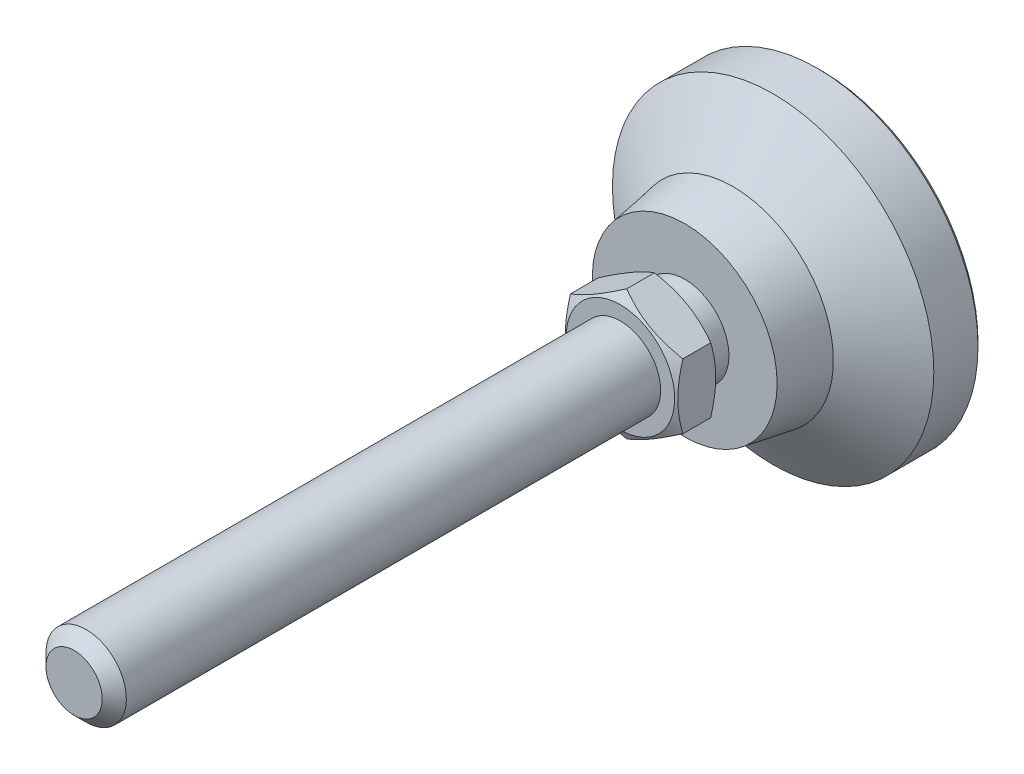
ISO-10303-21;
HEADER;
FILE_DESCRIPTION(('STEP AP214'),'2;1');
FILE_NAME('part.step','',(''),(''),'','','');
FILE_SCHEMA(('AUTOMOTIVE_DESIGN { 1 0 10303 214 1 1 1 1 }'));
ENDSEC;
DATA;
#1=APPLICATION_CONTEXT('core data for automotive mechanical design processes');
#2=APPLICATION_PROTOCOL_DEFINITION('international standard','automotive_design',2000,#1);
#3=PRODUCT_CONTEXT('',#1,'mechanical');
#4=PRODUCT('Part','Part','',(#3));
#5=PRODUCT_RELATED_PRODUCT_CATEGORY('part','',(#4));
#6=PRODUCT_DEFINITION_FORMATION('','',#4);
#7=PRODUCT_DEFINITION_CONTEXT('part definition',#1,'design');
#8=PRODUCT_DEFINITION('design','',#6,#7);
#9=PRODUCT_DEFINITION_SHAPE('','',#8);
#10=(LENGTH_UNIT() NAMED_UNIT(*) SI_UNIT(.MILLI.,.METRE.));
#11=(NAMED_UNIT(*) PLANE_ANGLE_UNIT() SI_UNIT($,.RADIAN.));
#12=(NAMED_UNIT(*) SI_UNIT($,.STERADIAN.) SOLID_ANGLE_UNIT());
#13=UNCERTAINTY_MEASURE_WITH_UNIT(LENGTH_MEASURE(1.E-05),#10,'distance_accuracy_value','');
#14=(GEOMETRIC_REPRESENTATION_CONTEXT(3) GLOBAL_UNCERTAINTY_ASSIGNED_CONTEXT((#13)) GLOBAL_UNIT_ASSIGNED_CONTEXT((#10,
#11,#12)) REPRESENTATION_CONTEXT('',''));
#15=CARTESIAN_POINT('',(0.,0.,0.));
#16=DIRECTION('',(0.,0.,1.));
#17=DIRECTION('',(1.,0.,0.));
#18=AXIS2_PLACEMENT_3D('',#15,#16,#17);
#19=CARTESIAN_POINT('',(-5.49999999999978,0.,20.));
#20=DIRECTION('',(0.,0.,1.));
#21=DIRECTION('',(0.,-1.,0.));
#22=AXIS2_PLACEMENT_3D('',#19,#20,#21);
#23=PLANE('',#22);
#24=CARTESIAN_POINT('',(0.,0.,20.));
#25=DIRECTION('',(0.,0.,-1.));
#26=DIRECTION('',(0.,1.,0.));
#27=AXIS2_PLACEMENT_3D('',#24,#25,#26);
#28=CIRCLE('',#27,5.49999999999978);
#29=CARTESIAN_POINT('',(0.,5.49999999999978,20.));
#30=VERTEX_POINT('',#29);
#31=EDGE_CURVE('E99',#30,#30,#28,.T.);
#32=ORIENTED_EDGE('',*,*,#31,.F.);
#33=EDGE_LOOP('',(#32));
#34=FACE_BOUND('',#33,.T.);
#35=CARTESIAN_POINT('',(0.,0.,20.));
#36=DIRECTION('',(0.,0.,-1.));
#37=DIRECTION('',(0.,1.,0.));
#38=AXIS2_PLACEMENT_3D('',#35,#36,#37);
#39=CIRCLE('',#38,6.75);
#40=CARTESIAN_POINT('',(0.,6.75,20.));
#41=VERTEX_POINT('',#40);
#42=EDGE_CURVE('E79',#41,#41,#39,.T.);
#43=ORIENTED_EDGE('',*,*,#42,.T.);
#44=EDGE_LOOP('',(#43));
#45=FACE_BOUND('',#44,.T.);
#46=ADVANCED_FACE('F14',(#34,#45),#23,.F.);
#47=CARTESIAN_POINT('',(0.,0.,-1.00000000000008));
#48=DIRECTION('',(0.,0.,-1.));
#49=DIRECTION('',(0.,1.,0.));
#50=AXIS2_PLACEMENT_3D('',#47,#48,#49);
#51=CYLINDRICAL_SURFACE('',#50,20.);
#52=CARTESIAN_POINT('',(0.,0.,0.500000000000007));
#53=DIRECTION('',(0.,0.,-1.));
#54=DIRECTION('',(0.,1.,0.));
#55=AXIS2_PLACEMENT_3D('',#52,#53,#54);
#56=CIRCLE('',#55,20.);
#57=CARTESIAN_POINT('',(0.,20.,0.500000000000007));
#58=VERTEX_POINT('',#57);
#59=EDGE_CURVE('E117',#58,#58,#56,.F.);
#60=ORIENTED_EDGE('',*,*,#59,.T.);
#61=EDGE_LOOP('',(#60));
#62=FACE_BOUND('',#61,.T.);
#63=CARTESIAN_POINT('',(0.,0.,6.));
#64=DIRECTION('',(0.,0.,-1.));
#65=DIRECTION('',(0.,1.,0.));
#66=AXIS2_PLACEMENT_3D('',#63,#64,#65);
#67=CIRCLE('',#66,20.);
#68=CARTESIAN_POINT('',(0.,20.,6.));
#69=VERTEX_POINT('',#68);
#70=EDGE_CURVE('E111',#69,#69,#67,.T.);
#71=ORIENTED_EDGE('',*,*,#70,.T.);
#72=EDGE_LOOP('',(#71));
#73=FACE_BOUND('',#72,.T.);
#74=ADVANCED_FACE('F239',(#62,#73),#51,.T.);
#75=CARTESIAN_POINT('',(0.,0.,11.));
#76=DIRECTION('',(0.,0.,-1.));
#77=DIRECTION('',(0.,1.,0.));
#78=AXIS2_PLACEMENT_3D('',#75,#76,#77);
#79=CONICAL_SURFACE('',#78,12.5,0.98279372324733);
#80=ORIENTED_EDGE('',*,*,#70,.F.);
#81=EDGE_LOOP('',(#80));
#82=FACE_BOUND('',#81,.T.);
#83=CARTESIAN_POINT('',(0.,0.,11.));
#84=DIRECTION('',(0.,0.,-1.));
#85=DIRECTION('',(0.,1.,0.));
#86=AXIS2_PLACEMENT_3D('',#83,#84,#85);
#87=CIRCLE('',#86,12.5);
#88=CARTESIAN_POINT('',(0.,12.5,11.));
#89=VERTEX_POINT('',#88);
#90=EDGE_CURVE('E108',#89,#89,#87,.T.);
#91=ORIENTED_EDGE('',*,*,#90,.T.);
#92=EDGE_LOOP('',(#91));
#93=FACE_BOUND('',#92,.T.);
#94=ADVANCED_FACE('F246',(#82,#93),#79,.T.);
#95=CARTESIAN_POINT('',(0.,0.,17.));
#96=DIRECTION('',(0.,0.,-1.));
#97=DIRECTION('',(0.,1.,0.));
#98=AXIS2_PLACEMENT_3D('',#95,#96,#97);
#99=CONICAL_SURFACE('',#98,11.5,0.165148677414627);
#100=ORIENTED_EDGE('',*,*,#90,.F.);
#101=EDGE_LOOP('',(#100));
#102=FACE_BOUND('',#101,.T.);
#103=CARTESIAN_POINT('',(0.,0.,17.));
#104=DIRECTION('',(0.,0.,-1.));
#105=DIRECTION('',(0.,1.,0.));
#106=AXIS2_PLACEMENT_3D('',#103,#104,#105);
#107=CIRCLE('',#106,11.5);
#108=CARTESIAN_POINT('',(0.,11.5,17.));
#109=VERTEX_POINT('',#108);
#110=EDGE_CURVE('E105',#109,#109,#107,.T.);
#111=ORIENTED_EDGE('',*,*,#110,.T.);
#112=EDGE_LOOP('',(#111));
#113=FACE_BOUND('',#112,.T.);
#114=ADVANCED_FACE('F258',(#102,#113),#99,.T.);
#115=CARTESIAN_POINT('',(-11.5,0.,17.));
#116=DIRECTION('',(0.,0.,-1.));
#117=DIRECTION('',(0.,1.,0.));
#118=AXIS2_PLACEMENT_3D('',#115,#116,#117);
#119=PLANE('',#118);
#120=ORIENTED_EDGE('',*,*,#110,.F.);
#121=EDGE_LOOP('',(#120));
#122=FACE_BOUND('',#121,.T.);
#123=CARTESIAN_POINT('',(0.,0.,17.));
#124=DIRECTION('',(0.,0.,-1.));
#125=DIRECTION('',(0.,1.,0.));
#126=AXIS2_PLACEMENT_3D('',#123,#124,#125);
#127=CIRCLE('',#126,5.49999999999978);
#128=CARTESIAN_POINT('',(0.,5.49999999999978,17.));
#129=VERTEX_POINT('',#128);
#130=EDGE_CURVE('E102',#129,#129,#127,.T.);
#131=ORIENTED_EDGE('',*,*,#130,.T.);
#132=EDGE_LOOP('',(#131));
#133=FACE_BOUND('',#132,.T.);
#134=ADVANCED_FACE('F254',(#122,#133),#119,.F.);
#135=CARTESIAN_POINT('',(0.,0.,-1.00000000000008));
#136=DIRECTION('',(0.,0.,-1.));
#137=DIRECTION('',(0.,1.,0.));
#138=AXIS2_PLACEMENT_3D('',#135,#136,#137);
#139=CYLINDRICAL_SURFACE('',#138,5.49999999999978);
#140=ORIENTED_EDGE('',*,*,#130,.F.);
#141=EDGE_LOOP('',(#140));
#142=FACE_BOUND('',#141,.T.);
#143=ORIENTED_EDGE('',*,*,#31,.T.);
#144=EDGE_LOOP('',(#143));
#145=FACE_BOUND('',#144,.T.);
#146=ADVANCED_FACE('F251',(#142,#145),#139,.T.);
#147=CARTESIAN_POINT('',(0.,0.,0.));
#148=DIRECTION('',(0.,0.,-1.));
#149=DIRECTION('',(0.,1.,0.));
#150=AXIS2_PLACEMENT_3D('',#147,#148,#149);
#151=PLANE('',#150);
#152=CARTESIAN_POINT('',(0.,0.,0.));
#153=DIRECTION('',(0.,0.,-1.));
#154=DIRECTION('',(0.,1.,0.));
#155=AXIS2_PLACEMENT_3D('',#152,#153,#154);
#156=CIRCLE('',#155,19.5);
#157=CARTESIAN_POINT('',(0.,19.5,0.));
#158=VERTEX_POINT('',#157);
#159=EDGE_CURVE('E114',#158,#158,#156,.T.);
#160=ORIENTED_EDGE('',*,*,#159,.T.);
#161=EDGE_LOOP('',(#160));
#162=FACE_BOUND('',#161,.T.);
#163=ADVANCED_FACE('F197',(#162),#151,.T.);
#164=CARTESIAN_POINT('',(0.,0.,0.));
#165=DIRECTION('',(0.,0.,1.));
#166=DIRECTION('',(0.,-1.,0.));
#167=AXIS2_PLACEMENT_3D('',#164,#165,#166);
#168=CONICAL_SURFACE('',#167,19.5,0.785398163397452);
#169=ORIENTED_EDGE('',*,*,#59,.F.);
#170=EDGE_LOOP('',(#169));
#171=FACE_BOUND('',#170,.T.);
#172=ORIENTED_EDGE('',*,*,#159,.F.);
#173=EDGE_LOOP('',(#172));
#174=FACE_BOUND('',#173,.T.);
#175=ADVANCED_FACE('F16',(#171,#174),#168,.T.);
#176=CARTESIAN_POINT('',(0.,0.,20.));
#177=DIRECTION('',(0.,0.,1.));
#178=DIRECTION('',(0.,-1.,0.));
#179=AXIS2_PLACEMENT_3D('',#176,#177,#178);
#180=CONICAL_SURFACE('',#179,6.75,1.0471975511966);
#181=CARTESIAN_POINT('',(-7.,10.8136101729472,23.5400483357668));
#182=CARTESIAN_POINT('',(-7.,10.5082244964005,23.3920791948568));
#183=CARTESIAN_POINT('',(-7.,10.2021332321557,23.2455411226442));
#184=CARTESIAN_POINT('',(-7.,9.58816411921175,22.9561328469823));
#185=CARTESIAN_POINT('',(-7.,9.28028599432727,22.8132632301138));
#186=CARTESIAN_POINT('',(-7.,8.66076112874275,22.5312697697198));
#187=CARTESIAN_POINT('',(-7.,8.34910296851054,22.3921709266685));
#188=CARTESIAN_POINT('',(-7.,7.72329302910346,22.1197223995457));
#189=CARTESIAN_POINT('',(-7.,7.40914136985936,21.9863724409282));
#190=CARTESIAN_POINT('',(-7.,6.76787104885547,21.7228423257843));
#191=CARTESIAN_POINT('',(-7.,6.44065611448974,21.5928951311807));
#192=CARTESIAN_POINT('',(-7.,5.78238328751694,21.3429382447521));
#193=CARTESIAN_POINT('',(-7.,5.45132496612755,21.2229296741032));
#194=CARTESIAN_POINT('',(-7.,4.78546807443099,20.9960318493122));
#195=CARTESIAN_POINT('',(-7.,4.45067878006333,20.8891156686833));
#196=CARTESIAN_POINT('',(-7.,3.776310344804,20.6918596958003));
#197=CARTESIAN_POINT('',(-7.,3.43673276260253,20.6015146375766));
#198=CARTESIAN_POINT('',(-7.,2.75441347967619,20.4422483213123));
#199=CARTESIAN_POINT('',(-7.,2.4116992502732,20.3732125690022));
#200=CARTESIAN_POINT('',(-7.,1.89454111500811,20.2886510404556));
#201=CARTESIAN_POINT('',(-7.,1.72162758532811,20.2636280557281));
#202=CARTESIAN_POINT('',(-7.,1.37495549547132,20.2204045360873));
#203=CARTESIAN_POINT('',(-7.,1.20119701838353,20.202203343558));
#204=CARTESIAN_POINT('',(-7.,0.85531918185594,20.1732121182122));
#205=CARTESIAN_POINT('',(-7.,0.683207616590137,20.1623294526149));
#206=CARTESIAN_POINT('',(-7.,0.338678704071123,20.147849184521));
#207=CARTESIAN_POINT('',(-7.,0.166261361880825,20.1442514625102));
#208=CARTESIAN_POINT('',(-7.,-0.178571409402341,20.1444267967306));
#209=CARTESIAN_POINT('',(-7.,-0.350986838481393,20.1481998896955));
#210=CARTESIAN_POINT('',(-7.,-0.695506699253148,20.1630253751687));
#211=CARTESIAN_POINT('',(-7.,-0.867611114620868,20.1740781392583));
#212=CARTESIAN_POINT('',(-7.,-1.28251851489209,20.2092666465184));
#213=CARTESIAN_POINT('',(-7.,-1.5250286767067,20.236927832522));
#214=CARTESIAN_POINT('',(-7.,-2.00820982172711,20.3051851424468));
#215=CARTESIAN_POINT('',(-7.,-2.24888054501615,20.3457830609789));
#216=CARTESIAN_POINT('',(-7.,-2.96788042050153,20.4848258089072));
#217=CARTESIAN_POINT('',(-7.,-3.44292089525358,20.600493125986));
#218=CARTESIAN_POINT('',(-7.,-4.15317912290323,20.8005767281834));
#219=CARTESIAN_POINT('',(-7.,-4.39209330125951,20.8726218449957));
#220=CARTESIAN_POINT('',(-7.,-4.86760030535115,21.0240718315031));
#221=CARTESIAN_POINT('',(-7.,-5.10419311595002,21.1034767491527));
#222=CARTESIAN_POINT('',(-7.,-5.57513421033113,21.2683825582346));
#223=CARTESIAN_POINT('',(-7.,-5.80948323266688,21.3538813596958));
#224=CARTESIAN_POINT('',(-7.,-6.27624792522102,21.5299812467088));
#225=CARTESIAN_POINT('',(-7.,-6.50866361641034,21.6205822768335));
#226=CARTESIAN_POINT('',(-7.,-7.0502709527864,21.837469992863));
#227=CARTESIAN_POINT('',(-7.,-7.35878563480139,21.965443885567));
#228=CARTESIAN_POINT('',(-7.,-7.97325115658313,22.2274226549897));
#229=CARTESIAN_POINT('',(-7.,-8.27920184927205,22.3614278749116));
#230=CARTESIAN_POINT('',(-7.,-8.88900199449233,22.6342773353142));
#231=CARTESIAN_POINT('',(-7.,-9.19285103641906,22.7731224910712));
#232=CARTESIAN_POINT('',(-7.,-9.79874619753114,23.0546992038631));
#233=CARTESIAN_POINT('',(-7.,-10.1007922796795,23.1974308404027));
#234=CARTESIAN_POINT('',(-7.,-10.7036741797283,23.4862066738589));
#235=CARTESIAN_POINT('',(-7.,-11.0045084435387,23.6322541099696));
#236=CARTESIAN_POINT('',(-7.,-11.6048939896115,23.9269650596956));
#237=CARTESIAN_POINT('',(-7.,-11.904445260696,24.0756285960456));
#238=CARTESIAN_POINT('',(-7.,-12.8014014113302,24.524819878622));
#239=CARTESIAN_POINT('',(-7.,-13.3971848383,24.828585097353));
#240=CARTESIAN_POINT('',(-7.,-14.5369005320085,25.4170734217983));
#241=CARTESIAN_POINT('',(-7.,-15.081081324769,25.7013173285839));
#242=CARTESIAN_POINT('',(-7.,-16.1674154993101,26.27369406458));
#243=CARTESIAN_POINT('',(-7.,-16.7095688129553,26.5618270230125));
#244=CARTESIAN_POINT('',(-7.,-17.7909917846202,27.1403679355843));
#245=CARTESIAN_POINT('',(-7.,-18.3302652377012,27.430768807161));
#246=CARTESIAN_POINT('',(-7.,-19.407511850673,28.013905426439));
#247=CARTESIAN_POINT('',(-7.,-19.9454850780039,28.3066410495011));
#248=CARTESIAN_POINT('',(-7.,-20.482977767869,28.6002504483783));
#249=B_SPLINE_CURVE_WITH_KNOTS('',3,(#181,#182,#183,#184,#185,#186,#187,#188,#189,#190,#191,
#192,#193,#194,#195,#196,#197,#198,#199,#200,#201,#202,#203,#204,#205,#206,#207,#208,#209,#210,
#211,#212,#213,#214,#215,#216,#217,#218,#219,#220,#221,#222,#223,#224,#225,#226,#227,#228,#229,
#230,#231,#232,#233,#234,#235,#236,#237,#238,#239,#240,#241,#242,#243,#244,#245,#246,#247,#248),
.UNSPECIFIED.,.F.,.F.,(4,2,2,2,2,2,2,2,2,2,2,2,2,2,2,2,2,2,2,2,2,2,2,2,2,2,2,2,2,2,2,2,2,4),(0.,
1.01804873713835,2.03625925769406,3.06008465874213,4.08386111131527,5.13995695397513,
6.19617177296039,7.25017648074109,8.30384566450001,9.35175079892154,9.87578158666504,
10.3997618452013,10.9169784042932,11.4341864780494,11.951397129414,12.4686341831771,
13.2004675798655,13.9324025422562,15.3971016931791,16.1456624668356,16.8942281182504,
17.6425382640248,18.3908402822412,19.3927663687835,20.3947495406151,21.3969232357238,
22.3991174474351,23.402336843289,24.4055649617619,26.4117673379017,28.2535827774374,
30.0954595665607,31.9329345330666,33.7703120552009),.UNSPECIFIED.);
#250=CARTESIAN_POINT('',(-7.,4.04145188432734,20.7695523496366));
#251=VERTEX_POINT('',#250);
#252=CARTESIAN_POINT('',(-7.,-4.04145188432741,20.7695523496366));
#253=VERTEX_POINT('',#252);
#254=EDGE_CURVE('E85',#251,#253,#249,.T.);
#255=ORIENTED_EDGE('',*,*,#254,.F.);
#256=CARTESIAN_POINT('',(0.000200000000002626,8.08301923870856,20.7696190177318));
#257=CARTESIAN_POINT('',(-0.153667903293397,7.99418356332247,20.7183374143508));
#258=CARTESIAN_POINT('',(-0.308109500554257,7.90501666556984,20.669383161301));
#259=CARTESIAN_POINT('',(-0.618246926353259,7.725958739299,20.5767703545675));
#260=CARTESIAN_POINT('',(-0.773943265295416,7.63606741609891,20.5331140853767));
#261=CARTESIAN_POINT('',(-1.24352516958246,7.36495417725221,20.4109491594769));
#262=CARTESIAN_POINT('',(-1.5592643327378,7.18266208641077,20.3414631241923));
#263=CARTESIAN_POINT('',(-2.03176224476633,6.90986528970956,20.2599825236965));
#264=CARTESIAN_POINT('',(-2.18710922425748,6.82017566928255,20.2367710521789));
#265=CARTESIAN_POINT('',(-2.49850511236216,6.64039116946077,20.1978487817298));
#266=CARTESIAN_POINT('',(-2.6545539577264,6.55029632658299,20.1821373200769));
#267=CARTESIAN_POINT('',(-2.96692267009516,6.36995016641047,20.1586154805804));
#268=CARTESIAN_POINT('',(-3.12324202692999,6.27969914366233,20.1507961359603));
#269=CARTESIAN_POINT('',(-3.43601650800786,6.09911871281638,20.1432178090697));
#270=CARTESIAN_POINT('',(-3.59247162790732,6.00878930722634,20.1434585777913));
#271=CARTESIAN_POINT('',(-4.02110687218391,5.76131663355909,20.1551972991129));
#272=CARTESIAN_POINT('',(-4.29314668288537,5.6042543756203,20.1749033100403));
#273=CARTESIAN_POINT('',(-4.83541944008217,5.29117305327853,20.2373910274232));
#274=CARTESIAN_POINT('',(-5.10565047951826,5.13515508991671,20.2801940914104));
#275=CARTESIAN_POINT('',(-5.64901454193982,4.82144370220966,20.3871892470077));
#276=CARTESIAN_POINT('',(-5.92207900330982,4.66378986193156,20.4518346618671));
#277=CARTESIAN_POINT('',(-6.46413578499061,4.35083323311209,20.5985536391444));
#278=CARTESIAN_POINT('',(-6.73313504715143,4.19552643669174,20.6805927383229));
#279=CARTESIAN_POINT('',(-7.0002,4.0413364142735,20.7696190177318));
#280=B_SPLINE_CURVE_WITH_KNOTS('',3,(#256,#257,#258,#259,#260,#261,#262,#263,#264,#265,#266,
#267,#268,#269,#270,#271,#272,#273,#274,#275,#276,#277,#278,#279),.UNSPECIFIED.,.F.,.F.,(4,2,2,
2,2,2,2,2,2,2,2,4),(0.,0.554727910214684,1.10969417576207,2.22193274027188,2.76443041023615,
3.30688013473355,3.84871284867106,4.39052882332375,5.33376515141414,6.27787517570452,
7.24292418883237,8.20607866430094),.UNSPECIFIED.);
#281=CARTESIAN_POINT('',(0.,8.08290376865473,20.7695523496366));
#282=VERTEX_POINT('',#281);
#283=EDGE_CURVE('E206',#282,#251,#280,.T.);
#284=ORIENTED_EDGE('',*,*,#283,.F.);
#285=CARTESIAN_POINT('',(7.0002,4.04133641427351,20.7696190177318));
#286=CARTESIAN_POINT('',(6.8463320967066,4.1301720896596,20.7183374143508));
#287=CARTESIAN_POINT('',(6.69189049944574,4.21933898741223,20.669383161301));
#288=CARTESIAN_POINT('',(6.38175307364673,4.39839691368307,20.5767703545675));
#289=CARTESIAN_POINT('',(6.22605673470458,4.48828823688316,20.5331140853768));
#290=CARTESIAN_POINT('',(5.75647483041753,4.75940147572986,20.4109491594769));
#291=CARTESIAN_POINT('',(5.44073566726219,4.9416935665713,20.3414631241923));
#292=CARTESIAN_POINT('',(4.96823775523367,5.21449036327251,20.2599825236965));
#293=CARTESIAN_POINT('',(4.81289077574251,5.30417998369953,20.2367710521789));
#294=CARTESIAN_POINT('',(4.50149488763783,5.4839644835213,20.1978487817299));
#295=CARTESIAN_POINT('',(4.34544604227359,5.57405932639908,20.1821373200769));
#296=CARTESIAN_POINT('',(4.03307732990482,5.7544054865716,20.1586154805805));
#297=CARTESIAN_POINT('',(3.87675797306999,5.84465650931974,20.1507961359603));
#298=CARTESIAN_POINT('',(3.56398349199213,6.02523694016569,20.1432178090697));
#299=CARTESIAN_POINT('',(3.40752837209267,6.11556634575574,20.1434585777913));
#300=CARTESIAN_POINT('',(2.97889312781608,6.36303901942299,20.1551972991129));
#301=CARTESIAN_POINT('',(2.70685331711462,6.52010127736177,20.1749033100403));
#302=CARTESIAN_POINT('',(2.16458055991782,6.83318259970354,20.2373910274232));
#303=CARTESIAN_POINT('',(1.89434952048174,6.98920056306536,20.2801940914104));
#304=CARTESIAN_POINT('',(1.35098545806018,7.30291195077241,20.3871892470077));
#305=CARTESIAN_POINT('',(1.07792099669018,7.46056579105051,20.4518346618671));
#306=CARTESIAN_POINT('',(0.535864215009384,7.77352241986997,20.5985536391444));
#307=CARTESIAN_POINT('',(0.266864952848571,7.92882921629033,20.6805927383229));
#308=CARTESIAN_POINT('',(-0.000199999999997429,8.08301923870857,20.7696190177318));
#309=B_SPLINE_CURVE_WITH_KNOTS('',3,(#285,#286,#287,#288,#289,#290,#291,#292,#293,#294,#295,
#296,#297,#298,#299,#300,#301,#302,#303,#304,#305,#306,#307,#308),.UNSPECIFIED.,.F.,.F.,(4,2,2,
2,2,2,2,2,2,2,2,4),(0.,0.554727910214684,1.10969417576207,2.22193274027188,2.76443041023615,
3.30688013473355,3.84871284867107,4.39052882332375,5.33376515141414,6.27787517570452,
7.24292418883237,8.20607866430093),.UNSPECIFIED.);
#310=CARTESIAN_POINT('',(7.,4.04145188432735,20.7695523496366));
#311=VERTEX_POINT('',#310);
#312=EDGE_CURVE('E213',#311,#282,#309,.T.);
#313=ORIENTED_EDGE('',*,*,#312,.F.);
#314=CARTESIAN_POINT('',(7.,10.8136101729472,23.5400483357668));
#315=CARTESIAN_POINT('',(7.,10.5082244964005,23.3920791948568));
#316=CARTESIAN_POINT('',(7.,10.2021332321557,23.2455411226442));
#317=CARTESIAN_POINT('',(7.,9.58816411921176,22.9561328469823));
#318=CARTESIAN_POINT('',(7.,9.28028599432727,22.8132632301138));
#319=CARTESIAN_POINT('',(7.,8.66076112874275,22.5312697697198));
#320=CARTESIAN_POINT('',(7.,8.34910296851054,22.3921709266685));
#321=CARTESIAN_POINT('',(7.,7.72329302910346,22.1197223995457));
#322=CARTESIAN_POINT('',(7.,7.40914136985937,21.9863724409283));
#323=CARTESIAN_POINT('',(7.,6.76787104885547,21.7228423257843));
#324=CARTESIAN_POINT('',(7.,6.44065611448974,21.5928951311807));
#325=CARTESIAN_POINT('',(7.,5.78238328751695,21.3429382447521));
#326=CARTESIAN_POINT('',(7.,5.45132496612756,21.2229296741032));
#327=CARTESIAN_POINT('',(7.,4.78546807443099,20.9960318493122));
#328=CARTESIAN_POINT('',(7.,4.45067878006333,20.8891156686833));
#329=CARTESIAN_POINT('',(7.,3.776310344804,20.6918596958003));
#330=CARTESIAN_POINT('',(7.,3.43673276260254,20.6015146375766));
#331=CARTESIAN_POINT('',(7.,2.7544134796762,20.4422483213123));
#332=CARTESIAN_POINT('',(7.,2.4116992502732,20.3732125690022));
#333=CARTESIAN_POINT('',(7.,1.89454111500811,20.2886510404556));
#334=CARTESIAN_POINT('',(7.,1.72162758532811,20.2636280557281));
#335=CARTESIAN_POINT('',(7.,1.37495549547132,20.2204045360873));
#336=CARTESIAN_POINT('',(7.,1.20119701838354,20.202203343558));
#337=CARTESIAN_POINT('',(7.,0.855319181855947,20.1732121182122));
#338=CARTESIAN_POINT('',(7.,0.683207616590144,20.1623294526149));
#339=CARTESIAN_POINT('',(7.,0.33867870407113,20.147849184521));
#340=CARTESIAN_POINT('',(7.,0.166261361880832,20.1442514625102));
#341=CARTESIAN_POINT('',(7.,-0.178571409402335,20.1444267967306));
#342=CARTESIAN_POINT('',(7.,-0.350986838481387,20.1481998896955));
#343=CARTESIAN_POINT('',(7.,-0.695506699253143,20.1630253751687));
#344=CARTESIAN_POINT('',(7.,-0.867611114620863,20.1740781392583));
#345=CARTESIAN_POINT('',(7.,-1.28251851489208,20.2092666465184));
#346=CARTESIAN_POINT('',(7.,-1.52502867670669,20.236927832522));
#347=CARTESIAN_POINT('',(7.,-2.00820982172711,20.3051851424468));
#348=CARTESIAN_POINT('',(7.,-2.24888054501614,20.3457830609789));
#349=CARTESIAN_POINT('',(7.,-2.96788042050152,20.4848258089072));
#350=CARTESIAN_POINT('',(7.,-3.44292089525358,20.600493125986));
#351=CARTESIAN_POINT('',(7.,-4.15317912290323,20.8005767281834));
#352=CARTESIAN_POINT('',(7.,-4.39209330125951,20.8726218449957));
#353=CARTESIAN_POINT('',(7.,-4.86760030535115,21.0240718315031));
#354=CARTESIAN_POINT('',(7.,-5.10419311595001,21.1034767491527));
#355=CARTESIAN_POINT('',(7.,-5.57513421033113,21.2683825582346));
#356=CARTESIAN_POINT('',(7.,-5.80948323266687,21.3538813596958));
#357=CARTESIAN_POINT('',(7.,-6.27624792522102,21.5299812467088));
#358=CARTESIAN_POINT('',(7.,-6.50866361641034,21.6205822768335));
#359=CARTESIAN_POINT('',(7.,-7.0502709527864,21.837469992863));
#360=CARTESIAN_POINT('',(7.,-7.35878563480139,21.965443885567));
#361=CARTESIAN_POINT('',(7.,-7.97325115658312,22.2274226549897));
#362=CARTESIAN_POINT('',(7.,-8.27920184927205,22.3614278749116));
#363=CARTESIAN_POINT('',(7.,-8.88900199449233,22.6342773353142));
#364=CARTESIAN_POINT('',(7.,-9.19285103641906,22.7731224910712));
#365=CARTESIAN_POINT('',(7.,-9.79874619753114,23.0546992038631));
#366=CARTESIAN_POINT('',(7.,-10.1007922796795,23.1974308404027));
#367=CARTESIAN_POINT('',(7.,-10.7036741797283,23.4862066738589));
#368=CARTESIAN_POINT('',(7.,-11.0045084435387,23.6322541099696));
#369=CARTESIAN_POINT('',(7.,-11.6048939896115,23.9269650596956));
#370=CARTESIAN_POINT('',(7.,-11.904445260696,24.0756285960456));
#371=CARTESIAN_POINT('',(7.,-12.8014014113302,24.524819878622));
#372=CARTESIAN_POINT('',(7.,-13.3971848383,24.828585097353));
#373=CARTESIAN_POINT('',(7.,-14.5369005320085,25.4170734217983));
#374=CARTESIAN_POINT('',(7.,-15.081081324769,25.7013173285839));
#375=CARTESIAN_POINT('',(7.,-16.1674154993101,26.27369406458));
#376=CARTESIAN_POINT('',(7.,-16.7095688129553,26.5618270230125));
#377=CARTESIAN_POINT('',(7.,-17.7909917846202,27.1403679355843));
#378=CARTESIAN_POINT('',(7.,-18.3302652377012,27.430768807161));
#379=CARTESIAN_POINT('',(7.,-19.407511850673,28.013905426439));
#380=CARTESIAN_POINT('',(7.,-19.9454850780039,28.3066410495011));
#381=CARTESIAN_POINT('',(7.,-20.482977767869,28.6002504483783));
#382=B_SPLINE_CURVE_WITH_KNOTS('',3,(#314,#315,#316,#317,#318,#319,#320,#321,#322,#323,#324,
#325,#326,#327,#328,#329,#330,#331,#332,#333,#334,#335,#336,#337,#338,#339,#340,#341,#342,#343,
#344,#345,#346,#347,#348,#349,#350,#351,#352,#353,#354,#355,#356,#357,#358,#359,#360,#361,#362,
#363,#364,#365,#366,#367,#368,#369,#370,#371,#372,#373,#374,#375,#376,#377,#378,#379,#380,#381),
.UNSPECIFIED.,.F.,.F.,(4,2,2,2,2,2,2,2,2,2,2,2,2,2,2,2,2,2,2,2,2,2,2,2,2,2,2,2,2,2,2,2,2,4),(0.,
1.01804873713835,2.03625925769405,3.06008465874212,4.08386111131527,5.13995695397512,
6.19617177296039,7.25017648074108,8.30384566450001,9.35175079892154,9.87578158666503,
10.3997618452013,10.9169784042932,11.4341864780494,11.951397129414,12.4686341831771,
13.2004675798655,13.9324025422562,15.3971016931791,16.1456624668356,16.8942281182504,
17.6425382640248,18.3908402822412,19.3927663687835,20.3947495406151,21.3969232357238,
22.3991174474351,23.402336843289,24.4055649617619,26.4117673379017,28.2535827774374,
30.0954595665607,31.9329345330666,33.7703120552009),.UNSPECIFIED.);
#383=CARTESIAN_POINT('',(7.,-4.04145188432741,20.7695523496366));
#384=VERTEX_POINT('',#383);
#385=EDGE_CURVE('E35',#384,#311,#382,.F.);
#386=ORIENTED_EDGE('',*,*,#385,.F.);
#387=CARTESIAN_POINT('',(-0.000199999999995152,-8.08301923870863,20.7696190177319));
#388=CARTESIAN_POINT('',(0.153667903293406,-7.99418356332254,20.7183374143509));
#389=CARTESIAN_POINT('',(0.308109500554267,-7.90501666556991,20.669383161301));
#390=CARTESIAN_POINT('',(0.618246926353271,-7.72595873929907,20.5767703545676));
#391=CARTESIAN_POINT('',(0.773943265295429,-7.63606741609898,20.5331140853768));
#392=CARTESIAN_POINT('',(1.24352516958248,-7.36495417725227,20.4109491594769));
#393=CARTESIAN_POINT('',(1.55926433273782,-7.18266208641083,20.3414631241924));
#394=CARTESIAN_POINT('',(2.03176224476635,-6.90986528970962,20.2599825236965));
#395=CARTESIAN_POINT('',(2.18710922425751,-6.82017566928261,20.2367710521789));
#396=CARTESIAN_POINT('',(2.49850511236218,-6.64039116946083,20.1978487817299));
#397=CARTESIAN_POINT('',(2.65455395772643,-6.55029632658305,20.1821373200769));
#398=CARTESIAN_POINT('',(2.9669226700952,-6.36995016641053,20.1586154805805));
#399=CARTESIAN_POINT('',(3.12324202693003,-6.27969914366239,20.1507961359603));
#400=CARTESIAN_POINT('',(3.43601650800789,-6.09911871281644,20.1432178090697));
#401=CARTESIAN_POINT('',(3.59247162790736,-6.00878930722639,20.1434585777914));
#402=CARTESIAN_POINT('',(4.02110687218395,-5.76131663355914,20.1551972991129));
#403=CARTESIAN_POINT('',(4.29314668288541,-5.60425437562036,20.1749033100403));
#404=CARTESIAN_POINT('',(4.8354194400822,-5.29117305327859,20.2373910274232));
#405=CARTESIAN_POINT('',(5.10565047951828,-5.13515508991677,20.2801940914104));
#406=CARTESIAN_POINT('',(5.64901454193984,-4.82144370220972,20.3871892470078));
#407=CARTESIAN_POINT('',(5.92207900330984,-4.66378986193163,20.4518346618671));
#408=CARTESIAN_POINT('',(6.46413578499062,-4.35083323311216,20.5985536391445));
#409=CARTESIAN_POINT('',(6.73313504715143,-4.19552643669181,20.680592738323));
#410=CARTESIAN_POINT('',(7.0002,-4.04133641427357,20.7696190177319));
#411=B_SPLINE_CURVE_WITH_KNOTS('',3,(#387,#388,#389,#390,#391,#392,#393,#394,#395,#396,#397,
#398,#399,#400,#401,#402,#403,#404,#405,#406,#407,#408,#409,#410),.UNSPECIFIED.,.F.,.F.,(4,2,2,
2,2,2,2,2,2,2,2,4),(0.,0.554727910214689,1.10969417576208,2.2219327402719,2.76443041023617,
3.30688013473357,3.8487128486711,4.39052882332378,5.33376515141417,6.27787517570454,
7.24292418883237,8.20607866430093),.UNSPECIFIED.);
#412=CARTESIAN_POINT('',(0.,-8.08290376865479,20.7695523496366));
#413=VERTEX_POINT('',#412);
#414=EDGE_CURVE('E72',#413,#384,#411,.T.);
#415=ORIENTED_EDGE('',*,*,#414,.F.);
#416=CARTESIAN_POINT('',(-7.0002,-4.04133641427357,20.7696190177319));
#417=CARTESIAN_POINT('',(-6.8463320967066,-4.13017208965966,20.7183374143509));
#418=CARTESIAN_POINT('',(-6.69189049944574,-4.21933898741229,20.669383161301));
#419=CARTESIAN_POINT('',(-6.38175307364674,-4.39839691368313,20.5767703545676));
#420=CARTESIAN_POINT('',(-6.22605673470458,-4.48828823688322,20.5331140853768));
#421=CARTESIAN_POINT('',(-5.75647483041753,-4.75940147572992,20.4109491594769));
#422=CARTESIAN_POINT('',(-5.44073566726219,-4.94169356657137,20.3414631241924));
#423=CARTESIAN_POINT('',(-4.96823775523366,-5.21449036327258,20.2599825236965));
#424=CARTESIAN_POINT('',(-4.8128907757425,-5.30417998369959,20.2367710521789));
#425=CARTESIAN_POINT('',(-4.50149488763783,-5.48396448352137,20.1978487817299));
#426=CARTESIAN_POINT('',(-4.34544604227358,-5.57405932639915,20.1821373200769));
#427=CARTESIAN_POINT('',(-4.03307732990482,-5.75440548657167,20.1586154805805));
#428=CARTESIAN_POINT('',(-3.87675797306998,-5.84465650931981,20.1507961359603));
#429=CARTESIAN_POINT('',(-3.56398349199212,-6.02523694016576,20.1432178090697));
#430=CARTESIAN_POINT('',(-3.40752837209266,-6.11556634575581,20.1434585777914));
#431=CARTESIAN_POINT('',(-2.97889312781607,-6.36303901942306,20.1551972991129));
#432=CARTESIAN_POINT('',(-2.7068533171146,-6.52010127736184,20.1749033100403));
#433=CARTESIAN_POINT('',(-2.16458055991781,-6.83318259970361,20.2373910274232));
#434=CARTESIAN_POINT('',(-1.89434952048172,-6.98920056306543,20.2801940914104));
#435=CARTESIAN_POINT('',(-1.35098545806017,-7.30291195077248,20.3871892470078));
#436=CARTESIAN_POINT('',(-1.07792099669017,-7.46056579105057,20.4518346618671));
#437=CARTESIAN_POINT('',(-0.535864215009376,-7.77352241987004,20.5985536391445));
#438=CARTESIAN_POINT('',(-0.266864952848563,-7.92882921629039,20.680592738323));
#439=CARTESIAN_POINT('',(0.000200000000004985,-8.08301923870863,20.7696190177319));
#440=B_SPLINE_CURVE_WITH_KNOTS('',3,(#416,#417,#418,#419,#420,#421,#422,#423,#424,#425,#426,
#427,#428,#429,#430,#431,#432,#433,#434,#435,#436,#437,#438,#439),.UNSPECIFIED.,.F.,.F.,(4,2,2,
2,2,2,2,2,2,2,2,4),(0.,0.554727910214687,1.10969417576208,2.22193274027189,2.76443041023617,
3.30688013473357,3.84871284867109,4.39052882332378,5.33376515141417,6.27787517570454,
7.24292418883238,8.20607866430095),.UNSPECIFIED.);
#441=EDGE_CURVE('E75',#253,#413,#440,.T.);
#442=ORIENTED_EDGE('',*,*,#441,.F.);
#443=EDGE_LOOP('',(#255,#284,#313,#386,#415,#442));
#444=FACE_BOUND('',#443,.T.);
#445=ORIENTED_EDGE('',*,*,#42,.F.);
#446=EDGE_LOOP('',(#445));
#447=FACE_BOUND('',#446,.T.);
#448=ADVANCED_FACE('F73',(#444,#447),#180,.T.);
#449=CARTESIAN_POINT('',(0.,0.,93.));
#450=DIRECTION('',(0.,0.,-1.));
#451=DIRECTION('',(0.,1.,0.));
#452=AXIS2_PLACEMENT_3D('',#449,#450,#451);
#453=PLANE('',#452);
#454=CARTESIAN_POINT('',(0.,0.,93.));
#455=DIRECTION('',(0.,0.,-1.));
#456=DIRECTION('',(0.,1.,0.));
#457=AXIS2_PLACEMENT_3D('',#454,#455,#456);
#458=CIRCLE('',#457,3.5);
#459=CARTESIAN_POINT('',(0.,3.5,93.));
#460=VERTEX_POINT('',#459);
#461=EDGE_CURVE('E90',#460,#460,#458,.T.);
#462=ORIENTED_EDGE('',*,*,#461,.F.);
#463=EDGE_LOOP('',(#462));
#464=FACE_BOUND('',#463,.T.);
#465=ADVANCED_FACE('F319',(#464),#453,.F.);
#466=CARTESIAN_POINT('',(0.,0.,93.));
#467=DIRECTION('',(0.,0.,-1.));
#468=DIRECTION('',(0.,1.,0.));
#469=AXIS2_PLACEMENT_3D('',#466,#467,#468);
#470=CONICAL_SURFACE('',#469,3.5,0.785398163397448);
#471=CARTESIAN_POINT('',(0.,0.,91.5));
#472=DIRECTION('',(0.,0.,-1.));
#473=DIRECTION('',(0.,1.,0.));
#474=AXIS2_PLACEMENT_3D('',#471,#472,#473);
#475=CIRCLE('',#474,5.);
#476=CARTESIAN_POINT('',(0.,5.,91.5));
#477=VERTEX_POINT('',#476);
#478=EDGE_CURVE('E95',#477,#477,#475,.T.);
#479=ORIENTED_EDGE('',*,*,#478,.F.);
#480=EDGE_LOOP('',(#479));
#481=FACE_BOUND('',#480,.T.);
#482=ORIENTED_EDGE('',*,*,#461,.T.);
#483=EDGE_LOOP('',(#482));
#484=FACE_BOUND('',#483,.T.);
#485=ADVANCED_FACE('F326',(#481,#484),#470,.T.);
#486=CARTESIAN_POINT('',(0.,0.,-7.74975615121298));
#487=DIRECTION('',(0.,0.,-1.));
#488=DIRECTION('',(0.,1.,0.));
#489=AXIS2_PLACEMENT_3D('',#486,#487,#488);
#490=CYLINDRICAL_SURFACE('',#489,5.);
#491=CARTESIAN_POINT('',(0.,0.,25.));
#492=DIRECTION('',(0.,0.,-1.));
#493=DIRECTION('',(0.,1.,0.));
#494=AXIS2_PLACEMENT_3D('',#491,#492,#493);
#495=CIRCLE('',#494,5.);
#496=CARTESIAN_POINT('',(0.,5.,25.));
#497=VERTEX_POINT('',#496);
#498=EDGE_CURVE('E28',#497,#497,#495,.F.);
#499=ORIENTED_EDGE('',*,*,#498,.T.);
#500=EDGE_LOOP('',(#499));
#501=FACE_BOUND('',#500,.T.);
#502=ORIENTED_EDGE('',*,*,#478,.T.);
#503=EDGE_LOOP('',(#502));
#504=FACE_BOUND('',#503,.T.);
#505=ADVANCED_FACE('F122',(#501,#504),#490,.T.);
#506=CARTESIAN_POINT('',(-3.99999999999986,0.,25.));
#507=DIRECTION('',(0.,0.,-1.));
#508=DIRECTION('',(0.,1.,0.));
#509=AXIS2_PLACEMENT_3D('',#506,#507,#508);
#510=PLANE('',#509);
#511=ORIENTED_EDGE('',*,*,#498,.F.);
#512=EDGE_LOOP('',(#511));
#513=FACE_BOUND('',#512,.T.);
#514=CARTESIAN_POINT('',(0.,0.,25.));
#515=DIRECTION('',(0.,0.,-1.));
#516=DIRECTION('',(0.,1.,0.));
#517=AXIS2_PLACEMENT_3D('',#514,#515,#516);
#518=CIRCLE('',#517,6.75);
#519=CARTESIAN_POINT('',(0.,6.75,25.));
#520=VERTEX_POINT('',#519);
#521=EDGE_CURVE('E84',#520,#520,#518,.T.);
#522=ORIENTED_EDGE('',*,*,#521,.F.);
#523=EDGE_LOOP('',(#522));
#524=FACE_BOUND('',#523,.T.);
#525=ADVANCED_FACE('F125',(#513,#524),#510,.F.);
#526=CARTESIAN_POINT('',(0.,0.,23.4026774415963));
#527=DIRECTION('',(0.,0.,-1.));
#528=DIRECTION('',(0.,1.,0.));
#529=AXIS2_PLACEMENT_3D('',#526,#527,#528);
#530=CONICAL_SURFACE('',#529,9.51664382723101,1.0471975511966);
#531=CARTESIAN_POINT('',(7.0002,-4.04133641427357,24.230380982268));
#532=CARTESIAN_POINT('',(6.84633209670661,-4.13017208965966,24.281662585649));
#533=CARTESIAN_POINT('',(6.69189049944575,-4.21933898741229,24.3306168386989));
#534=CARTESIAN_POINT('',(6.38175307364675,-4.39839691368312,24.4232296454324));
#535=CARTESIAN_POINT('',(6.22605673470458,-4.48828823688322,24.4668859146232));
#536=CARTESIAN_POINT('',(5.75647483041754,-4.75940147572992,24.589050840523));
#537=CARTESIAN_POINT('',(5.4407356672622,-4.94169356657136,24.6585368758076));
#538=CARTESIAN_POINT('',(4.96823775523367,-5.21449036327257,24.7400174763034));
#539=CARTESIAN_POINT('',(4.81289077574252,-5.30417998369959,24.763228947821));
#540=CARTESIAN_POINT('',(4.50149488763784,-5.48396448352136,24.80215121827));
#541=CARTESIAN_POINT('',(4.34544604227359,-5.57405932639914,24.817862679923));
#542=CARTESIAN_POINT('',(4.03307732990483,-5.75440548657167,24.8413845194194));
#543=CARTESIAN_POINT('',(3.87675797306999,-5.84465650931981,24.8492038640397));
#544=CARTESIAN_POINT('',(3.56398349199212,-6.02523694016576,24.8567821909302));
#545=CARTESIAN_POINT('',(3.40752837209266,-6.11556634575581,24.8565414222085));
#546=CARTESIAN_POINT('',(2.97889312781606,-6.36303901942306,24.8448027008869));
#547=CARTESIAN_POINT('',(2.7068533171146,-6.52010127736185,24.8250966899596));
#548=CARTESIAN_POINT('',(2.1645805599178,-6.83318259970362,24.7626089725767));
#549=CARTESIAN_POINT('',(1.89434952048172,-6.98920056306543,24.7198059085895));
#550=CARTESIAN_POINT('',(1.35098545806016,-7.30291195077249,24.6128107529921));
#551=CARTESIAN_POINT('',(1.07792099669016,-7.46056579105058,24.5481653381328));
#552=CARTESIAN_POINT('',(0.535864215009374,-7.77352241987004,24.4014463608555));
#553=CARTESIAN_POINT('',(0.266864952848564,-7.9288292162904,24.3194072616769));
#554=CARTESIAN_POINT('',(-0.000199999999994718,-8.08301923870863,24.230380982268));
#555=B_SPLINE_CURVE_WITH_KNOTS('',3,(#531,#532,#533,#534,#535,#536,#537,#538,#539,#540,#541,
#542,#543,#544,#545,#546,#547,#548,#549,#550,#551,#552,#553,#554),.UNSPECIFIED.,.F.,.F.,(4,2,2,
2,2,2,2,2,2,2,2,4),(0.,0.554727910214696,1.10969417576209,2.2219327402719,2.76443041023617,
3.30688013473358,3.8487128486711,4.3905288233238,5.33376515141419,6.27787517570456,
7.2429241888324,8.20607866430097),.UNSPECIFIED.);
#556=CARTESIAN_POINT('',(7.,-4.04145188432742,24.2304476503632));
#557=VERTEX_POINT('',#556);
#558=CARTESIAN_POINT('',(0.,-8.08290376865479,24.2304476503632));
#559=VERTEX_POINT('',#558);
#560=EDGE_CURVE('E9',#557,#559,#555,.T.);
#561=ORIENTED_EDGE('',*,*,#560,.F.);
#562=CARTESIAN_POINT('',(7.,10.8136101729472,21.4599516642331));
#563=CARTESIAN_POINT('',(7.,10.5082244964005,21.6079208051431));
#564=CARTESIAN_POINT('',(7.,10.2021332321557,21.7544588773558));
#565=CARTESIAN_POINT('',(7.,9.58816411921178,22.0438671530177));
#566=CARTESIAN_POINT('',(7.,9.28028599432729,22.1867367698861));
#567=CARTESIAN_POINT('',(7.,8.66076112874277,22.4687302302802));
#568=CARTESIAN_POINT('',(7.,8.34910296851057,22.6078290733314));
#569=CARTESIAN_POINT('',(7.,7.72329302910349,22.8802776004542));
#570=CARTESIAN_POINT('',(7.,7.4091413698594,23.0136275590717));
#571=CARTESIAN_POINT('',(7.,6.7678710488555,23.2771576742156));
#572=CARTESIAN_POINT('',(7.,6.44065611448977,23.4071048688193));
#573=CARTESIAN_POINT('',(7.,5.78238328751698,23.6570617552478));
#574=CARTESIAN_POINT('',(7.,5.45132496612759,23.7770703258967));
#575=CARTESIAN_POINT('',(7.,4.78546807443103,24.0039681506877));
#576=CARTESIAN_POINT('',(7.,4.45067878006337,24.1108843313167));
#577=CARTESIAN_POINT('',(7.,3.77631034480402,24.3081403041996));
#578=CARTESIAN_POINT('',(7.,3.43673276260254,24.3984853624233));
#579=CARTESIAN_POINT('',(7.,2.75441347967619,24.5577516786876));
#580=CARTESIAN_POINT('',(7.,2.41169925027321,24.6267874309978));
#581=CARTESIAN_POINT('',(7.,1.89454111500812,24.7113489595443));
#582=CARTESIAN_POINT('',(7.,1.72162758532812,24.7363719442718));
#583=CARTESIAN_POINT('',(7.,1.37495549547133,24.7795954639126));
#584=CARTESIAN_POINT('',(7.,1.20119701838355,24.7977966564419));
#585=CARTESIAN_POINT('',(7.,0.855319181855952,24.8267878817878));
#586=CARTESIAN_POINT('',(7.,0.683207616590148,24.837670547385));
#587=CARTESIAN_POINT('',(7.,0.338678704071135,24.8521508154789));
#588=CARTESIAN_POINT('',(7.,0.166261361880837,24.8557485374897));
#589=CARTESIAN_POINT('',(7.,-0.178571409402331,24.8555732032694));
#590=CARTESIAN_POINT('',(7.,-0.350986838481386,24.8518001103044));
#591=CARTESIAN_POINT('',(7.,-0.695506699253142,24.8369746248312));
#592=CARTESIAN_POINT('',(7.,-0.867611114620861,24.8259218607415));
#593=CARTESIAN_POINT('',(7.,-1.28251851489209,24.7907333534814));
#594=CARTESIAN_POINT('',(7.,-1.52502867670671,24.7630721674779));
#595=CARTESIAN_POINT('',(7.,-2.00820982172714,24.6948148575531));
#596=CARTESIAN_POINT('',(7.,-2.24888054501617,24.654216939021));
#597=CARTESIAN_POINT('',(7.,-2.96788042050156,24.5151741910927));
#598=CARTESIAN_POINT('',(7.,-3.44292089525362,24.3995068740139));
#599=CARTESIAN_POINT('',(7.,-4.15317912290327,24.1994232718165));
#600=CARTESIAN_POINT('',(7.,-4.39209330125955,24.1273781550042));
#601=CARTESIAN_POINT('',(7.,-4.86760030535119,23.9759281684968));
#602=CARTESIAN_POINT('',(7.,-5.10419311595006,23.8965232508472));
#603=CARTESIAN_POINT('',(7.,-5.57513421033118,23.7316174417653));
#604=CARTESIAN_POINT('',(7.,-5.80948323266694,23.6461186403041));
#605=CARTESIAN_POINT('',(7.,-6.27624792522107,23.4700187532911));
#606=CARTESIAN_POINT('',(7.,-6.50866361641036,23.3794177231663));
#607=CARTESIAN_POINT('',(7.,-7.05027095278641,23.1625300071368));
#608=CARTESIAN_POINT('',(7.,-7.35878563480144,23.0345561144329));
#609=CARTESIAN_POINT('',(7.,-7.97325115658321,22.7725773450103));
#610=CARTESIAN_POINT('',(7.,-8.27920184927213,22.6385721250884));
#611=CARTESIAN_POINT('',(7.,-8.8890019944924,22.3657226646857));
#612=CARTESIAN_POINT('',(7.,-9.19285103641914,22.2268775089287));
#613=CARTESIAN_POINT('',(7.,-9.79874619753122,21.9453007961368));
#614=CARTESIAN_POINT('',(7.,-10.1007922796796,21.8025691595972));
#615=CARTESIAN_POINT('',(7.,-10.7036741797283,21.513793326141));
#616=CARTESIAN_POINT('',(7.,-11.0045084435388,21.3677458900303));
#617=CARTESIAN_POINT('',(7.,-11.6048939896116,21.0730349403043));
#618=CARTESIAN_POINT('',(7.,-11.9044452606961,20.9243714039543));
#619=CARTESIAN_POINT('',(7.,-12.8014014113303,20.4751801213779));
#620=CARTESIAN_POINT('',(7.,-13.3971848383,20.1714149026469));
#621=CARTESIAN_POINT('',(7.,-14.5369005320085,19.5829265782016));
#622=CARTESIAN_POINT('',(7.,-15.081081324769,19.298682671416));
#623=CARTESIAN_POINT('',(7.,-16.1674154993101,18.7263059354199));
#624=CARTESIAN_POINT('',(7.,-16.7095688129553,18.4381729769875));
#625=CARTESIAN_POINT('',(7.,-17.7909917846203,17.8596320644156));
#626=CARTESIAN_POINT('',(7.,-18.3302652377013,17.5692311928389));
#627=CARTESIAN_POINT('',(7.,-19.4075118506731,16.9860945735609));
#628=CARTESIAN_POINT('',(7.,-19.945485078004,16.6933589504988));
#629=CARTESIAN_POINT('',(7.,-20.482977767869,16.3997495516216));
#630=B_SPLINE_CURVE_WITH_KNOTS('',3,(#562,#563,#564,#565,#566,#567,#568,#569,#570,#571,#572,
#573,#574,#575,#576,#577,#578,#579,#580,#581,#582,#583,#584,#585,#586,#587,#588,#589,#590,#591,
#592,#593,#594,#595,#596,#597,#598,#599,#600,#601,#602,#603,#604,#605,#606,#607,#608,#609,#610,
#611,#612,#613,#614,#615,#616,#617,#618,#619,#620,#621,#622,#623,#624,#625,#626,#627,#628,#629),
.UNSPECIFIED.,.F.,.F.,(4,2,2,2,2,2,2,2,2,2,2,2,2,2,2,2,2,2,2,2,2,2,2,2,2,2,2,2,2,2,2,2,2,4),(0.,
1.01804873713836,2.03625925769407,3.06008465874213,4.08386111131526,5.13995695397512,
6.19617177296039,7.25017648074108,8.30384566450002,9.35175079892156,9.87578158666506,
10.3997618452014,10.9169784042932,11.4341864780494,11.951397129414,12.4686341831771,
13.2004675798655,13.9324025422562,15.3971016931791,16.1456624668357,16.8942281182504,
17.6425382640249,18.3908402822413,19.3927663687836,20.3947495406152,21.396923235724,
22.3991174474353,23.4023368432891,24.405564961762,26.4117673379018,28.2535827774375,
30.0954595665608,31.9329345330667,33.770312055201),.UNSPECIFIED.);
#631=CARTESIAN_POINT('',(7.,4.04145188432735,24.2304476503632));
#632=VERTEX_POINT('',#631);
#633=EDGE_CURVE('E133',#632,#557,#630,.T.);
#634=ORIENTED_EDGE('',*,*,#633,.F.);
#635=CARTESIAN_POINT('',(-0.000199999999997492,8.08301923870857,24.2303809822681));
#636=CARTESIAN_POINT('',(0.153667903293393,7.99418356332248,24.2816625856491));
#637=CARTESIAN_POINT('',(0.30810950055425,7.90501666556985,24.330616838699));
#638=CARTESIAN_POINT('',(0.618246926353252,7.72595873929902,24.4232296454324));
#639=CARTESIAN_POINT('',(0.773943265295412,7.63606741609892,24.4668859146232));
#640=CARTESIAN_POINT('',(1.24352516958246,7.36495417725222,24.589050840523));
#641=CARTESIAN_POINT('',(1.55926433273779,7.18266208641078,24.6585368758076));
#642=CARTESIAN_POINT('',(2.03176224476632,6.90986528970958,24.7400174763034));
#643=CARTESIAN_POINT('',(2.18710922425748,6.82017566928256,24.7632289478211));
#644=CARTESIAN_POINT('',(2.49850511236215,6.64039116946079,24.8021512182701));
#645=CARTESIAN_POINT('',(2.65455395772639,6.55029632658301,24.817862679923));
#646=CARTESIAN_POINT('',(2.96692267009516,6.36995016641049,24.8413845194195));
#647=CARTESIAN_POINT('',(3.12324202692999,6.27969914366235,24.8492038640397));
#648=CARTESIAN_POINT('',(3.43601650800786,6.0991187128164,24.8567821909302));
#649=CARTESIAN_POINT('',(3.59247162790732,6.00878930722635,24.8565414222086));
#650=CARTESIAN_POINT('',(4.02110687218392,5.7613166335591,24.8448027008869));
#651=CARTESIAN_POINT('',(4.29314668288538,5.60425437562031,24.8250966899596));
#652=CARTESIAN_POINT('',(4.83541944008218,5.29117305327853,24.7626089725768));
#653=CARTESIAN_POINT('',(5.10565047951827,5.13515508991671,24.7198059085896));
#654=CARTESIAN_POINT('',(5.64901454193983,4.82144370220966,24.6128107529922));
#655=CARTESIAN_POINT('',(5.92207900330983,4.66378986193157,24.5481653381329));
#656=CARTESIAN_POINT('',(6.46413578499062,4.3508332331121,24.4014463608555));
#657=CARTESIAN_POINT('',(6.73313504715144,4.19552643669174,24.319407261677));
#658=CARTESIAN_POINT('',(7.0002,4.04133641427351,24.2303809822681));
#659=B_SPLINE_CURVE_WITH_KNOTS('',3,(#635,#636,#637,#638,#639,#640,#641,#642,#643,#644,#645,
#646,#647,#648,#649,#650,#651,#652,#653,#654,#655,#656,#657,#658),.UNSPECIFIED.,.F.,.F.,(4,2,2,
2,2,2,2,2,2,2,2,4),(0.,0.554727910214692,1.10969417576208,2.22193274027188,2.76443041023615,
3.30688013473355,3.84871284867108,4.39052882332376,5.33376515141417,6.27787517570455,
7.24292418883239,8.20607866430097),.UNSPECIFIED.);
#660=CARTESIAN_POINT('',(0.,8.08290376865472,24.2304476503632));
#661=VERTEX_POINT('',#660);
#662=EDGE_CURVE('E136',#661,#632,#659,.T.);
#663=ORIENTED_EDGE('',*,*,#662,.F.);
#664=CARTESIAN_POINT('',(-7.0002,4.0413364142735,24.2303809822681));
#665=CARTESIAN_POINT('',(-6.84633209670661,4.13017208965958,24.2816625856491));
#666=CARTESIAN_POINT('',(-6.69189049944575,4.21933898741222,24.330616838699));
#667=CARTESIAN_POINT('',(-6.38175307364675,4.39839691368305,24.4232296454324));
#668=CARTESIAN_POINT('',(-6.22605673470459,4.48828823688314,24.4668859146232));
#669=CARTESIAN_POINT('',(-5.75647483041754,4.75940147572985,24.589050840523));
#670=CARTESIAN_POINT('',(-5.44073566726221,4.94169356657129,24.6585368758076));
#671=CARTESIAN_POINT('',(-4.96823775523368,5.21449036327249,24.7400174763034));
#672=CARTESIAN_POINT('',(-4.81289077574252,5.30417998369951,24.7632289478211));
#673=CARTESIAN_POINT('',(-4.50149488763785,5.48396448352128,24.8021512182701));
#674=CARTESIAN_POINT('',(-4.3454460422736,5.57405932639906,24.817862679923));
#675=CARTESIAN_POINT('',(-4.03307732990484,5.75440548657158,24.8413845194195));
#676=CARTESIAN_POINT('',(-3.87675797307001,5.84465650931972,24.8492038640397));
#677=CARTESIAN_POINT('',(-3.56398349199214,6.02523694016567,24.8567821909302));
#678=CARTESIAN_POINT('',(-3.40752837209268,6.11556634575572,24.8565414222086));
#679=CARTESIAN_POINT('',(-2.97889312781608,6.36303901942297,24.8448027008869));
#680=CARTESIAN_POINT('',(-2.70685331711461,6.52010127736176,24.8250966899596));
#681=CARTESIAN_POINT('',(-2.16458055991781,6.83318259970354,24.7626089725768));
#682=CARTESIAN_POINT('',(-1.89434952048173,6.98920056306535,24.7198059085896));
#683=CARTESIAN_POINT('',(-1.35098545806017,7.30291195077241,24.6128107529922));
#684=CARTESIAN_POINT('',(-1.07792099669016,7.4605657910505,24.5481653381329));
#685=CARTESIAN_POINT('',(-0.535864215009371,7.77352241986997,24.4014463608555));
#686=CARTESIAN_POINT('',(-0.266864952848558,7.92882921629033,24.319407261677));
#687=CARTESIAN_POINT('',(0.000200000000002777,8.08301923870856,24.2303809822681));
#688=B_SPLINE_CURVE_WITH_KNOTS('',3,(#664,#665,#666,#667,#668,#669,#670,#671,#672,#673,#674,
#675,#676,#677,#678,#679,#680,#681,#682,#683,#684,#685,#686,#687),.UNSPECIFIED.,.F.,.F.,(4,2,2,
2,2,2,2,2,2,2,2,4),(0.,0.554727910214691,1.10969417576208,2.22193274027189,2.76443041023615,
3.30688013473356,3.84871284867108,4.39052882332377,5.33376515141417,6.27787517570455,
7.24292418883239,8.20607866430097),.UNSPECIFIED.);
#689=CARTESIAN_POINT('',(-7.,4.04145188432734,24.2304476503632));
#690=VERTEX_POINT('',#689);
#691=EDGE_CURVE('E171',#690,#661,#688,.T.);
#692=ORIENTED_EDGE('',*,*,#691,.F.);
#693=CARTESIAN_POINT('',(-7.,10.8136101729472,21.4599516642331));
#694=CARTESIAN_POINT('',(-7.,10.5082244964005,21.6079208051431));
#695=CARTESIAN_POINT('',(-7.,10.2021332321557,21.7544588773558));
#696=CARTESIAN_POINT('',(-7.,9.58816411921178,22.0438671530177));
#697=CARTESIAN_POINT('',(-7.,9.28028599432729,22.1867367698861));
#698=CARTESIAN_POINT('',(-7.,8.66076112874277,22.4687302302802));
#699=CARTESIAN_POINT('',(-7.,8.34910296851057,22.6078290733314));
#700=CARTESIAN_POINT('',(-7.,7.72329302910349,22.8802776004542));
#701=CARTESIAN_POINT('',(-7.,7.4091413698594,23.0136275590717));
#702=CARTESIAN_POINT('',(-7.,6.7678710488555,23.2771576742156));
#703=CARTESIAN_POINT('',(-7.,6.44065611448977,23.4071048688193));
#704=CARTESIAN_POINT('',(-7.,5.78238328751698,23.6570617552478));
#705=CARTESIAN_POINT('',(-7.,5.45132496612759,23.7770703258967));
#706=CARTESIAN_POINT('',(-7.,4.78546807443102,24.0039681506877));
#707=CARTESIAN_POINT('',(-7.,4.45067878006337,24.1108843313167));
#708=CARTESIAN_POINT('',(-7.,3.77631034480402,24.3081403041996));
#709=CARTESIAN_POINT('',(-7.,3.43673276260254,24.3984853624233));
#710=CARTESIAN_POINT('',(-7.,2.75441347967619,24.5577516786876));
#711=CARTESIAN_POINT('',(-7.,2.4116992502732,24.6267874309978));
#712=CARTESIAN_POINT('',(-7.,1.89454111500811,24.7113489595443));
#713=CARTESIAN_POINT('',(-7.,1.72162758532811,24.7363719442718));
#714=CARTESIAN_POINT('',(-7.,1.37495549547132,24.7795954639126));
#715=CARTESIAN_POINT('',(-7.,1.20119701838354,24.7977966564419));
#716=CARTESIAN_POINT('',(-7.,0.855319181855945,24.8267878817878));
#717=CARTESIAN_POINT('',(-7.,0.683207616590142,24.837670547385));
#718=CARTESIAN_POINT('',(-7.,0.338678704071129,24.8521508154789));
#719=CARTESIAN_POINT('',(-7.,0.166261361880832,24.8557485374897));
#720=CARTESIAN_POINT('',(-7.,-0.178571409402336,24.8555732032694));
#721=CARTESIAN_POINT('',(-7.,-0.35098683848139,24.8518001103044));
#722=CARTESIAN_POINT('',(-7.,-0.695506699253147,24.8369746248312));
#723=CARTESIAN_POINT('',(-7.,-0.867611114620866,24.8259218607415));
#724=CARTESIAN_POINT('',(-7.,-1.28251851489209,24.7907333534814));
#725=CARTESIAN_POINT('',(-7.,-1.52502867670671,24.7630721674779));
#726=CARTESIAN_POINT('',(-7.,-2.00820982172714,24.6948148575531));
#727=CARTESIAN_POINT('',(-7.,-2.24888054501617,24.654216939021));
#728=CARTESIAN_POINT('',(-7.,-2.96788042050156,24.5151741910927));
#729=CARTESIAN_POINT('',(-7.,-3.44292089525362,24.3995068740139));
#730=CARTESIAN_POINT('',(-7.,-4.15317912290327,24.1994232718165));
#731=CARTESIAN_POINT('',(-7.,-4.39209330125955,24.1273781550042));
#732=CARTESIAN_POINT('',(-7.,-4.86760030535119,23.9759281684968));
#733=CARTESIAN_POINT('',(-7.,-5.10419311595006,23.8965232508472));
#734=CARTESIAN_POINT('',(-7.,-5.57513421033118,23.7316174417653));
#735=CARTESIAN_POINT('',(-7.,-5.80948323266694,23.6461186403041));
#736=CARTESIAN_POINT('',(-7.,-6.27624792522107,23.4700187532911));
#737=CARTESIAN_POINT('',(-7.,-6.50866361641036,23.3794177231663));
#738=CARTESIAN_POINT('',(-7.,-7.05027095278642,23.1625300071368));
#739=CARTESIAN_POINT('',(-7.,-7.35878563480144,23.0345561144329));
#740=CARTESIAN_POINT('',(-7.,-7.97325115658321,22.7725773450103));
#741=CARTESIAN_POINT('',(-7.,-8.27920184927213,22.6385721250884));
#742=CARTESIAN_POINT('',(-7.,-8.8890019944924,22.3657226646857));
#743=CARTESIAN_POINT('',(-7.,-9.19285103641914,22.2268775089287));
#744=CARTESIAN_POINT('',(-7.,-9.79874619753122,21.9453007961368));
#745=CARTESIAN_POINT('',(-7.,-10.1007922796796,21.8025691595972));
#746=CARTESIAN_POINT('',(-7.,-10.7036741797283,21.513793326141));
#747=CARTESIAN_POINT('',(-7.,-11.0045084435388,21.3677458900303));
#748=CARTESIAN_POINT('',(-7.,-11.6048939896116,21.0730349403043));
#749=CARTESIAN_POINT('',(-7.,-11.9044452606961,20.9243714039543));
#750=CARTESIAN_POINT('',(-7.,-12.8014014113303,20.4751801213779));
#751=CARTESIAN_POINT('',(-7.,-13.3971848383,20.1714149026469));
#752=CARTESIAN_POINT('',(-7.,-14.5369005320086,19.5829265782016));
#753=CARTESIAN_POINT('',(-7.,-15.081081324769,19.298682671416));
#754=CARTESIAN_POINT('',(-7.,-16.1674154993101,18.7263059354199));
#755=CARTESIAN_POINT('',(-7.,-16.7095688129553,18.4381729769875));
#756=CARTESIAN_POINT('',(-7.,-17.7909917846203,17.8596320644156));
#757=CARTESIAN_POINT('',(-7.,-18.3302652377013,17.5692311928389));
#758=CARTESIAN_POINT('',(-7.,-19.4075118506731,16.9860945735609));
#759=CARTESIAN_POINT('',(-7.,-19.945485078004,16.6933589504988));
#760=CARTESIAN_POINT('',(-7.,-20.482977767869,16.3997495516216));
#761=B_SPLINE_CURVE_WITH_KNOTS('',3,(#693,#694,#695,#696,#697,#698,#699,#700,#701,#702,#703,
#704,#705,#706,#707,#708,#709,#710,#711,#712,#713,#714,#715,#716,#717,#718,#719,#720,#721,#722,
#723,#724,#725,#726,#727,#728,#729,#730,#731,#732,#733,#734,#735,#736,#737,#738,#739,#740,#741,
#742,#743,#744,#745,#746,#747,#748,#749,#750,#751,#752,#753,#754,#755,#756,#757,#758,#759,#760),
.UNSPECIFIED.,.F.,.F.,(4,2,2,2,2,2,2,2,2,2,2,2,2,2,2,2,2,2,2,2,2,2,2,2,2,2,2,2,2,2,2,2,2,4),(0.,
1.01804873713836,2.03625925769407,3.06008465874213,4.08386111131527,5.13995695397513,
6.19617177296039,7.25017648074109,8.30384566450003,9.35175079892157,9.87578158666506,
10.3997618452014,10.9169784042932,11.4341864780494,11.951397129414,12.4686341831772,
13.2004675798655,13.9324025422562,15.3971016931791,16.1456624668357,16.8942281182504,
17.6425382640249,18.3908402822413,19.3927663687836,20.3947495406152,21.3969232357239,
22.3991174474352,23.4023368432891,24.405564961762,26.4117673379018,28.2535827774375,
30.0954595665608,31.9329345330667,33.770312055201),.UNSPECIFIED.);
#762=CARTESIAN_POINT('',(-7.,-4.04145188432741,24.2304476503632));
#763=VERTEX_POINT('',#762);
#764=EDGE_CURVE('E178',#763,#690,#761,.F.);
#765=ORIENTED_EDGE('',*,*,#764,.F.);
#766=CARTESIAN_POINT('',(0.000200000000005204,-8.08301923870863,24.230380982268));
#767=CARTESIAN_POINT('',(-0.153667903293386,-7.99418356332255,24.281662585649));
#768=CARTESIAN_POINT('',(-0.308109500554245,-7.90501666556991,24.3306168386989));
#769=CARTESIAN_POINT('',(-0.618246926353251,-7.72595873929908,24.4232296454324));
#770=CARTESIAN_POINT('',(-0.773943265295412,-7.63606741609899,24.4668859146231));
#771=CARTESIAN_POINT('',(-1.24352516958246,-7.36495417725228,24.589050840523));
#772=CARTESIAN_POINT('',(-1.5592643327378,-7.18266208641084,24.6585368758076));
#773=CARTESIAN_POINT('',(-2.03176224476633,-6.90986528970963,24.7400174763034));
#774=CARTESIAN_POINT('',(-2.18710922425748,-6.82017566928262,24.763228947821));
#775=CARTESIAN_POINT('',(-2.49850511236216,-6.64039116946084,24.80215121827));
#776=CARTESIAN_POINT('',(-2.65455395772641,-6.55029632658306,24.817862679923));
#777=CARTESIAN_POINT('',(-2.96692267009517,-6.36995016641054,24.8413845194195));
#778=CARTESIAN_POINT('',(-3.12324202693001,-6.2796991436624,24.8492038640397));
#779=CARTESIAN_POINT('',(-3.43601650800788,-6.09911871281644,24.8567821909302));
#780=CARTESIAN_POINT('',(-3.59247162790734,-6.00878930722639,24.8565414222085));
#781=CARTESIAN_POINT('',(-4.02110687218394,-5.76131663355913,24.8448027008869));
#782=CARTESIAN_POINT('',(-4.2931466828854,-5.60425437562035,24.8250966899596));
#783=CARTESIAN_POINT('',(-4.8354194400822,-5.29117305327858,24.7626089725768));
#784=CARTESIAN_POINT('',(-5.10565047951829,-5.13515508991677,24.7198059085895));
#785=CARTESIAN_POINT('',(-5.64901454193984,-4.82144370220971,24.6128107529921));
#786=CARTESIAN_POINT('',(-5.92207900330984,-4.66378986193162,24.5481653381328));
#787=CARTESIAN_POINT('',(-6.46413578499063,-4.35083323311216,24.4014463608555));
#788=CARTESIAN_POINT('',(-6.73313504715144,-4.1955264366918,24.319407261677));
#789=CARTESIAN_POINT('',(-7.0002,-4.04133641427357,24.230380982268));
#790=B_SPLINE_CURVE_WITH_KNOTS('',3,(#766,#767,#768,#769,#770,#771,#772,#773,#774,#775,#776,
#777,#778,#779,#780,#781,#782,#783,#784,#785,#786,#787,#788,#789),.UNSPECIFIED.,.F.,.F.,(4,2,2,
2,2,2,2,2,2,2,2,4),(0.,0.554727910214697,1.10969417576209,2.2219327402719,2.76443041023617,
3.30688013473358,3.84871284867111,4.3905288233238,5.3337651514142,6.27787517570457,
7.24292418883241,8.20607866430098),.UNSPECIFIED.);
#791=EDGE_CURVE('E185',#559,#763,#790,.T.);
#792=ORIENTED_EDGE('',*,*,#791,.F.);
#793=EDGE_LOOP('',(#561,#634,#663,#692,#765,#792));
#794=FACE_BOUND('',#793,.T.);
#795=ORIENTED_EDGE('',*,*,#521,.T.);
#796=EDGE_LOOP('',(#795));
#797=FACE_BOUND('',#796,.T.);
#798=ADVANCED_FACE('F128',(#794,#797),#530,.T.);
#799=CARTESIAN_POINT('',(0.,-8.08290376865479,20.));
#800=DIRECTION('',(0.5,-0.866025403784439,0.));
#801=DIRECTION('',(0.866025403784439,0.5,0.));
#802=AXIS2_PLACEMENT_3D('',#799,#800,#801);
#803=PLANE('',#802);
#804=DIRECTION('',(0.,0.,1.));
#805=VECTOR('',#804,1.);
#806=CARTESIAN_POINT('',(0.,-8.08290376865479,20.));
#807=LINE('',#806,#805);
#808=EDGE_CURVE('E43',#413,#559,#807,.T.);
#809=ORIENTED_EDGE('',*,*,#808,.F.);
#810=ORIENTED_EDGE('',*,*,#414,.T.);
#811=DIRECTION('',(0.,0.,1.));
#812=VECTOR('',#811,1.);
#813=CARTESIAN_POINT('',(7.,-4.04145188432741,20.));
#814=LINE('',#813,#812);
#815=EDGE_CURVE('E89',#384,#557,#814,.T.);
#816=ORIENTED_EDGE('',*,*,#815,.T.);
#817=ORIENTED_EDGE('',*,*,#560,.T.);
#818=EDGE_LOOP('',(#809,#810,#816,#817));
#819=FACE_BOUND('',#818,.T.);
#820=ADVANCED_FACE('F87',(#819),#803,.T.);
#821=CARTESIAN_POINT('',(7.,-4.04145188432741,20.));
#822=DIRECTION('',(1.,0.,0.));
#823=DIRECTION('',(0.,1.,0.));
#824=AXIS2_PLACEMENT_3D('',#821,#822,#823);
#825=PLANE('',#824);
#826=ORIENTED_EDGE('',*,*,#815,.F.);
#827=ORIENTED_EDGE('',*,*,#385,.T.);
#828=DIRECTION('',(0.,0.,1.));
#829=VECTOR('',#828,1.);
#830=CARTESIAN_POINT('',(7.,4.04145188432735,20.));
#831=LINE('',#830,#829);
#832=EDGE_CURVE('E92',#311,#632,#831,.T.);
#833=ORIENTED_EDGE('',*,*,#832,.T.);
#834=ORIENTED_EDGE('',*,*,#633,.T.);
#835=EDGE_LOOP('',(#826,#827,#833,#834));
#836=FACE_BOUND('',#835,.T.);
#837=ADVANCED_FACE('F157',(#836),#825,.T.);
#838=CARTESIAN_POINT('',(7.,4.04145188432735,20.));
#839=DIRECTION('',(0.5,0.866025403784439,0.));
#840=DIRECTION('',(-0.866025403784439,0.5,0.));
#841=AXIS2_PLACEMENT_3D('',#838,#839,#840);
#842=PLANE('',#841);
#843=ORIENTED_EDGE('',*,*,#832,.F.);
#844=ORIENTED_EDGE('',*,*,#312,.T.);
#845=DIRECTION('',(0.,0.,1.));
#846=VECTOR('',#845,1.);
#847=CARTESIAN_POINT('',(0.,8.08290376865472,20.));
#848=LINE('',#847,#846);
#849=EDGE_CURVE('E428',#282,#661,#848,.T.);
#850=ORIENTED_EDGE('',*,*,#849,.T.);
#851=ORIENTED_EDGE('',*,*,#662,.T.);
#852=EDGE_LOOP('',(#843,#844,#850,#851));
#853=FACE_BOUND('',#852,.T.);
#854=ADVANCED_FACE('F224',(#853),#842,.T.);
#855=CARTESIAN_POINT('',(0.,8.08290376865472,20.));
#856=DIRECTION('',(-0.5,0.866025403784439,0.));
#857=DIRECTION('',(-0.866025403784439,-0.5,0.));
#858=AXIS2_PLACEMENT_3D('',#855,#856,#857);
#859=PLANE('',#858);
#860=ORIENTED_EDGE('',*,*,#849,.F.);
#861=ORIENTED_EDGE('',*,*,#283,.T.);
#862=DIRECTION('',(0.,0.,1.));
#863=VECTOR('',#862,1.);
#864=CARTESIAN_POINT('',(-7.,4.04145188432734,20.));
#865=LINE('',#864,#863);
#866=EDGE_CURVE('E426',#251,#690,#865,.T.);
#867=ORIENTED_EDGE('',*,*,#866,.T.);
#868=ORIENTED_EDGE('',*,*,#691,.T.);
#869=EDGE_LOOP('',(#860,#861,#867,#868));
#870=FACE_BOUND('',#869,.T.);
#871=ADVANCED_FACE('F195',(#870),#859,.T.);
#872=CARTESIAN_POINT('',(-7.,4.04145188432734,20.));
#873=DIRECTION('',(-1.,0.,0.));
#874=DIRECTION('',(0.,-1.,0.));
#875=AXIS2_PLACEMENT_3D('',#872,#873,#874);
#876=PLANE('',#875);
#877=ORIENTED_EDGE('',*,*,#866,.F.);
#878=ORIENTED_EDGE('',*,*,#254,.T.);
#879=DIRECTION('',(0.,0.,1.));
#880=VECTOR('',#879,1.);
#881=CARTESIAN_POINT('',(-7.,-4.04145188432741,20.));
#882=LINE('',#881,#880);
#883=EDGE_CURVE('E83',#253,#763,#882,.T.);
#884=ORIENTED_EDGE('',*,*,#883,.T.);
#885=ORIENTED_EDGE('',*,*,#764,.T.);
#886=EDGE_LOOP('',(#877,#878,#884,#885));
#887=FACE_BOUND('',#886,.T.);
#888=ADVANCED_FACE('F191',(#887),#876,.T.);
#889=CARTESIAN_POINT('',(-7.,-4.04145188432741,20.));
#890=DIRECTION('',(-0.5,-0.866025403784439,0.));
#891=DIRECTION('',(0.866025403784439,-0.5,0.));
#892=AXIS2_PLACEMENT_3D('',#889,#890,#891);
#893=PLANE('',#892);
#894=ORIENTED_EDGE('',*,*,#883,.F.);
#895=ORIENTED_EDGE('',*,*,#441,.T.);
#896=ORIENTED_EDGE('',*,*,#808,.T.);
#897=ORIENTED_EDGE('',*,*,#791,.T.);
#898=EDGE_LOOP('',(#894,#895,#896,#897));
#899=FACE_BOUND('',#898,.T.);
#900=ADVANCED_FACE('F82',(#899),#893,.T.);
#901=CLOSED_SHELL('',(#46,#74,#94,#114,#134,#146,#163,#175,#448,#465,#485,#505,#525,#798,#820,
#837,#854,#871,#888,#900));
#902=MANIFOLD_SOLID_BREP('B1',#901);
#903=ADVANCED_BREP_SHAPE_REPRESENTATION('',(#18,#902),#14);
#904=SHAPE_DEFINITION_REPRESENTATION(#9,#903);
ENDSEC;
END-ISO-10303-21;
